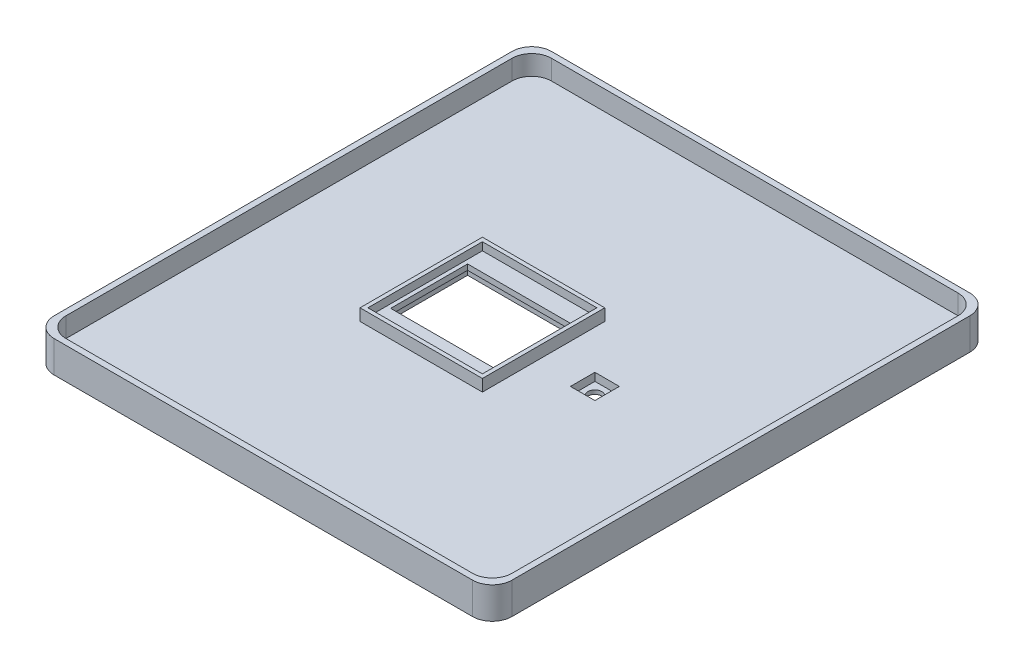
from build123d import *

# Parameters (mm, degrees)
SKETCH1_W           = 116
SKETCH1_H           = 126
BOSS_EXTRUDE1_DEPTH = 3
SKETCH2_W           = 116
SKETCH2_H           = 126
SKETCH2_W_2         = 113
SKETCH2_H_2         = 123
BOSS_EXTRUDE2_DEPTH = 5
FILLET1_R           = 5
SKETCH3_W           = 27
SKETCH3_H           = 19.5
SKETCH3_R           = 1.75
CUT_EXTRUDE1_DEPTH  = 5
SKETCH4_W           = 1.028086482
SKETCH4_H           = 8
SKETCH4_H_2         = 5.475045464
SKETCH4_W_2         = 1.028086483
CUT_EXTRUDE2_DEPTH  = 1
SKETCH5_W           = 30
SKETCH5_H           = 22.5
CUT_EXTRUDE3_DEPTH  = 2.6
SKETCH6_W           = 31
SKETCH6_H           = 31
SKETCH6_W_2         = 29
SKETCH6_H_2         = 29
BOSS_EXTRUDE3_DEPTH = 3
SKETCH7_W           = 29
SKETCH7_H           = 29
SKETCH7_W_2         = 27
SKETCH7_H_2         = 19.5
BOSS_EXTRUDE4_DEPTH = 1
SKETCH8_W           = 6.2
SKETCH8_H           = 6.2
CUT_EXTRUDE4_DEPTH  = 2


with BuildPart() as part:
    # Sketch1 → Boss-Extrude1 (new body)
    with BuildSketch(Plane(origin=(0, 0, 0), x_dir=(1, 0, 0), z_dir=(0, 1, 0))):
        Rectangle(SKETCH1_W, SKETCH1_H)
    extrude(amount=BOSS_EXTRUDE1_DEPTH)

    # Sketch2 → Boss-Extrude2 (add)
    with BuildSketch(Plane(origin=(0, 3, 0), x_dir=(1, 0, 0), z_dir=(0, 1, 0))):
        Rectangle(SKETCH2_W, SKETCH2_H)
        Rectangle(SKETCH2_W_2, SKETCH2_H_2, mode=Mode.SUBTRACT)
    extrude(amount=BOSS_EXTRUDE2_DEPTH)

    # Fillet1
    fillet1_edges = [part.edges().sort_by_distance(p)[0] for p in [
        (-56.5, 5.5, 61.5),
        (56.5, 5.5, 61.5),
        (56.5, 5.5, -61.5),
        (-56.5, 5.5, -61.5),
        (-58, 4, -63),
        (58, 4, -63),
        (58, 4, 63),
        (-58, 4, 63),
    ]]
    fillet(fillet1_edges, radius=FILLET1_R)

    # Sketch3 → Cut-Extrude1 (cut)
    with BuildSketch(Plane.XZ):
        with Locations((-7.5, 0)):
            Rectangle(SKETCH3_W, SKETCH3_H)
        with Locations(Location((21, 0, 0), (0, 0, 270))):
            Circle(SKETCH3_R)
    extrude(amount=-CUT_EXTRUDE1_DEPTH, mode=Mode.SUBTRACT)

    # Sketch4 → Cut-Extrude2 (cut)
    # profile 1 of 19: a face of its own
    with BuildSketch(Plane.XZ):
        Polygon((-46.226207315, 33.425283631), (-47.365831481, 33.425283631), (-44.349464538, 41.425283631), (-43.187209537, 41.425283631), (-40.170842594, 33.425283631), (-41.310466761, 33.425283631), (-42.081531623, 35.59299428), (-45.443827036, 35.59299428), align=None)
        Polygon((-43.790159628, 40.162806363), (-45.097898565, 36.553188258), (-42.43877551, 36.553188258), (-43.746514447, 40.162806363), align=None, mode=Mode.SUBTRACT)
    # profile 2 of 19: a face of its own
    with BuildSketch(Plane.XZ):
        with BuildLine():
            Line((-39.425641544, 38.900329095), (-38.442816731, 38.900329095))
            Line((-38.442816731, 38.900329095), (-38.442816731, 38.140579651))
            Line((-38.442816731, 38.140579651), (-38.397555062, 38.140579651))
            add(Edge.make_bspline(
                [(-38.397555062, 38.140579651), (-38.355324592, 38.206180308), (-38.269471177, 38.33954469), (-38.10105788, 38.515514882), (-37.903306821, 38.674796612), (-37.679016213, 38.814862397), (-37.437235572, 38.932096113), (-37.184721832, 39.016649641), (-36.927121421, 39.069234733), (-36.753291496, 39.075171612), (-36.666296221, 39.078142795)],
                knots=[0, 0, 0, 0, 0.91084183, 1.851717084, 2.833096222, 3.875309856, 4.938074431, 5.968501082, 6.983311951, 8, 8, 8, 8], degree=3))
            add(Edge.make_bspline(
                [(-36.666296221, 39.078142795), (-36.584874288, 39.076073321), (-36.426459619, 39.072046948), (-36.195789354, 39.04683856), (-35.979930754, 39.001384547), (-35.778218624, 38.938685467), (-35.590944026, 38.857003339), (-35.416644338, 38.759217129), (-35.259490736, 38.639589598), (-35.11639207, 38.504717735), (-34.987769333, 38.354274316), (-34.877619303, 38.185946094), (-34.783991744, 38.003292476), (-34.707428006, 37.804948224), (-34.648095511, 37.592178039), (-34.606749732, 37.363797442), (-34.579985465, 37.120675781), (-34.577471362, 36.953074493), (-34.576177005, 36.866786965)],
                knots=[0, 0, 0, 0, 1.127999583, 2.194638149, 3.209152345, 4.179425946, 5.11544511, 6.034797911, 6.940965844, 7.843900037, 8.754728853, 9.675988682, 10.624073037, 11.592996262, 12.616259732, 13.679130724, 14.805128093, 16, 16, 16, 16], degree=3))
            Line((-34.576177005, 36.866786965), (-34.576177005, 33.425283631))
            Line((-34.576177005, 33.425283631), (-35.604263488, 33.425283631))
            Line((-35.604263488, 33.425283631), (-35.604263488, 36.798894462))
            add(Edge.make_bspline(
                [(-35.604263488, 36.798894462), (-35.606729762, 36.853372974), (-35.611505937, 36.958875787), (-35.630985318, 37.111287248), (-35.660120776, 37.252865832), (-35.698183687, 37.384881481), (-35.748943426, 37.50550139), (-35.806240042, 37.617426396), (-35.877782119, 37.716275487), (-35.955554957, 37.808192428), (-36.047941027, 37.885031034), (-36.147384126, 37.954391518), (-36.25756983, 38.01249797), (-36.378275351, 38.058898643), (-36.508429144, 38.09686509), (-36.64887931, 38.121255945), (-36.798955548, 38.138595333), (-36.902248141, 38.13990341), (-36.955647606, 38.140579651)],
                knots=[0, 0, 0, 0, 1.204564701, 2.33275393, 3.3904596, 4.396236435, 5.362408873, 6.278428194, 7.166956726, 8.052849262, 8.930947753, 9.812670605, 10.728689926, 11.674925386, 12.665937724, 13.71907735, 14.820824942, 16, 16, 16, 16], degree=3))
            add(Edge.make_bspline(
                [(-36.955647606, 38.140579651), (-37.005833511, 38.138897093), (-37.105099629, 38.135569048), (-37.250660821, 38.113079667), (-37.390008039, 38.073635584), (-37.522374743, 38.018774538), (-37.648602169, 37.948037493), (-37.768673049, 37.862121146), (-37.881652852, 37.75941), (-37.987867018, 37.643708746), (-38.083266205, 37.517046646), (-38.168784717, 37.384381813), (-38.237792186, 37.243791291), (-38.296696, 37.09821523), (-38.341907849, 36.945531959), (-38.374070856, 36.786516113), (-38.39392901, 36.621584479), (-38.396337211, 36.509598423), (-38.397555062, 36.452965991)],
                knots=[0, 0, 0, 0, 0.975459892, 1.929428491, 2.854499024, 3.784241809, 4.707947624, 5.661283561, 6.647647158, 7.670643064, 8.709652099, 9.726625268, 10.733680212, 11.748926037, 12.776202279, 13.823780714, 14.899464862, 16, 16, 16, 16], degree=3))
            Line((-38.397555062, 36.452965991), (-38.397555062, 33.425283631))
            Line((-38.397555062, 33.425283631), (-39.425641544, 33.425283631))
            Line((-39.425641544, 33.425283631), (-39.425641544, 38.900329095))
        make_face()
    # profile 3 of 19: a face of its own
    with BuildSketch(Plane.XZ):
        with BuildLine():
            add(Edge.make_bspline(
                [(-31.242978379, 39.078142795), (-31.15021125, 39.076436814), (-30.96958618, 39.073115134), (-30.706497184, 39.042812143), (-30.458060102, 38.996941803), (-30.224577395, 38.930921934), (-30.006303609, 38.844839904), (-29.803041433, 38.739380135), (-29.614948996, 38.614735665), (-29.443321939, 38.471535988), (-29.287019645, 38.313846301), (-29.153041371, 38.138257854), (-29.03895201, 37.949728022), (-28.946139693, 37.746774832), (-28.873563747, 37.530041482), (-28.822072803, 37.298759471), (-28.790762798, 37.053549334), (-28.78755892, 36.885202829), (-28.785916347, 36.798894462)],
                knots=[0, 0, 0, 0, 1.173219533, 2.284352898, 3.345908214, 4.366555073, 5.348874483, 6.309307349, 7.258424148, 8.19757393, 9.132756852, 10.061282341, 10.984865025, 11.915190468, 12.87878731, 13.871061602, 14.908529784, 16, 16, 16, 16], degree=3))
            Line((-28.785916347, 36.798894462), (-28.785916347, 33.425283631))
            Line((-28.785916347, 33.425283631), (-29.76874116, 33.425283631))
            Line((-29.76874116, 33.425283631), (-29.76874116, 34.185033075))
            Line((-29.76874116, 34.185033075), (-29.814002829, 34.185033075))
            add(Edge.make_bspline(
                [(-29.814002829, 34.185033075), (-29.867992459, 34.110558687), (-29.973034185, 33.965662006), (-30.152441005, 33.772812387), (-30.345818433, 33.610205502), (-30.552402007, 33.475168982), (-30.774371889, 33.374115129), (-31.007665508, 33.2979375), (-31.255333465, 33.253979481), (-31.424932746, 33.248595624), (-31.511315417, 33.245853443)],
                knots=[0, 0, 0, 0, 1.089008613, 2.118765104, 3.110978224, 4.075960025, 5.032714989, 5.991597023, 6.977052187, 8, 8, 8, 8], degree=3))
            add(Edge.make_bspline(
                [(-31.511315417, 33.245853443), (-31.5852147, 33.247223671), (-31.730789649, 33.249922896), (-31.943822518, 33.276597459), (-32.147654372, 33.318680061), (-32.342742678, 33.376711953), (-32.528485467, 33.452489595), (-32.704443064, 33.545904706), (-32.871919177, 33.654086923), (-33.027498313, 33.779664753), (-33.168498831, 33.917406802), (-33.293101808, 34.064188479), (-33.399119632, 34.219827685), (-33.484470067, 34.385121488), (-33.551841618, 34.557862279), (-33.598179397, 34.739190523), (-33.628521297, 34.928676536), (-33.631998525, 35.058356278), (-33.633764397, 35.124212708)],
                knots=[0, 0, 0, 0, 1.120632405, 2.207545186, 3.251209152, 4.27532258, 5.290852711, 6.289095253, 7.293510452, 8.310979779, 9.316791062, 10.279701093, 11.227397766, 12.167022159, 13.096062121, 14.033871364, 15.001523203, 16, 16, 16, 16], degree=3))
            add(Edge.make_bspline(
                [(-33.633764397, 35.124212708), (-33.632156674, 35.193311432), (-33.629012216, 35.328457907), (-33.596858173, 35.525654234), (-33.547228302, 35.712256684), (-33.477669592, 35.888613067), (-33.386139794, 36.052684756), (-33.275010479, 36.20631246), (-33.143440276, 36.348712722), (-32.992736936, 36.479035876), (-32.826557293, 36.597553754), (-32.644216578, 36.698618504), (-32.449795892, 36.787433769), (-32.239977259, 36.855590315), (-32.017932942, 36.910516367), (-31.783095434, 36.951470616), (-31.53436972, 36.973420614), (-31.364255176, 36.976661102), (-31.276924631, 36.97832465)],
                knots=[0, 0, 0, 0, 0.982513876, 1.921646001, 2.834880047, 3.726188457, 4.611673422, 5.501232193, 6.418288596, 7.363908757, 8.331894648, 9.317186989, 10.326151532, 11.368758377, 12.451067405, 13.579254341, 14.757278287, 16, 16, 16, 16], degree=3))
            add(Edge.make_bspline(
                [(-31.276924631, 36.97832465), (-31.201991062, 36.977609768), (-31.055710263, 36.976214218), (-30.841583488, 36.959034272), (-30.637398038, 36.9341507), (-30.443680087, 36.896788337), (-30.260101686, 36.849896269), (-30.086451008, 36.793519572), (-29.922186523, 36.726238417), (-29.819495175, 36.671008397), (-29.76874116, 36.643711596)],
                knots=[0, 0, 0, 0, 1.151258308, 2.247417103, 3.299139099, 4.31088676, 5.276906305, 6.209116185, 7.114876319, 8, 8, 8, 8], degree=3))
            Line((-29.76874116, 36.643711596), (-29.76874116, 36.878102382))
            add(Edge.make_bspline(
                [(-29.76874116, 36.878102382), (-29.770017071, 36.921807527), (-29.772550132, 37.008575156), (-29.791736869, 37.136263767), (-29.826385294, 37.258580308), (-29.873545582, 37.375622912), (-29.933223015, 37.487648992), (-30.007693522, 37.593407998), (-30.092748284, 37.696066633), (-30.192977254, 37.789678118), (-30.300728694, 37.876288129), (-30.41252493, 37.954589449), (-30.531506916, 38.017748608), (-30.653192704, 38.071716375), (-30.780983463, 38.111275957), (-30.911784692, 38.143715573), (-31.048663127, 38.158572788), (-31.141117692, 38.161649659), (-31.188017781, 38.163210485)],
                knots=[0, 0, 0, 0, 0.987325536, 1.960133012, 2.908327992, 3.853313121, 4.806496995, 5.768965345, 6.771264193, 7.813222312, 8.860854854, 9.894171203, 10.89105799, 11.899768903, 12.896953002, 13.909842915, 14.939711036, 16, 16, 16, 16], degree=3))
            add(Edge.make_bspline(
                [(-31.188017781, 38.163210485), (-31.258214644, 38.161180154), (-31.395160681, 38.157219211), (-31.594924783, 38.121998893), (-31.783455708, 38.065624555), (-31.961786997, 37.986116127), (-32.126947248, 37.881094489), (-32.282474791, 37.755674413), (-32.425060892, 37.606098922), (-32.508266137, 37.493326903), (-32.550717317, 37.435790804)],
                knots=[0, 0, 0, 0, 1.044346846, 2.037401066, 3.00936587, 3.968031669, 4.933986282, 5.914946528, 6.936209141, 8, 8, 8, 8], degree=3))
            Line((-32.550717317, 37.435790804), (-33.455950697, 38.006411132))
            add(Edge.make_bspline(
                [(-33.455950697, 38.006411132), (-33.391663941, 38.09159897), (-33.265119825, 38.259285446), (-33.042750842, 38.479596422), (-32.797173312, 38.664894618), (-32.529038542, 38.816513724), (-32.239155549, 38.935402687), (-31.926785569, 39.018562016), (-31.592234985, 39.070042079), (-31.361714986, 39.075388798), (-31.242978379, 39.078142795)],
                knots=[0, 0, 0, 0, 0.998040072, 1.964574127, 2.918870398, 3.869801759, 4.840171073, 5.843473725, 6.889213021, 8, 8, 8, 8], degree=3))
        make_face()
        with BuildLine():
            add(Edge.make_bspline(
                [(-32.573348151, 35.101581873), (-32.569674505, 35.036850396), (-32.562437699, 34.909334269), (-32.493201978, 34.728176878), (-32.384002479, 34.564482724), (-32.233640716, 34.424838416), (-32.058938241, 34.30722055), (-31.862461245, 34.225310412), (-31.653351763, 34.17008498), (-31.507909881, 34.164997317), (-31.433723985, 34.162402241)],
                knots=[0, 0, 0, 0, 0.945466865, 1.862498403, 2.802240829, 3.807754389, 4.850454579, 5.873008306, 6.915080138, 8, 8, 8, 8], degree=3))
            add(Edge.make_bspline(
                [(-31.433723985, 34.162402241), (-31.380295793, 34.164021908), (-31.274577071, 34.167226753), (-31.118173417, 34.190860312), (-30.966464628, 34.227519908), (-30.818968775, 34.279808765), (-30.676618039, 34.348624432), (-30.537541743, 34.430499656), (-30.403752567, 34.529062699), (-30.276558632, 34.640862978), (-30.15800262, 34.761868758), (-30.053380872, 34.890187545), (-29.965742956, 35.024693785), (-29.894638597, 35.164811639), (-29.836578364, 35.308740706), (-29.798947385, 35.458975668), (-29.773019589, 35.61365048), (-29.770181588, 35.718969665), (-29.76874116, 35.772424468)],
                knots=[0, 0, 0, 0, 1.001766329, 1.982201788, 2.96018622, 3.925504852, 4.910927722, 5.921373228, 6.948211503, 8.022490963, 9.094486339, 10.121970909, 11.122666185, 12.098926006, 13.065407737, 14.026272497, 14.998233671, 16, 16, 16, 16], degree=3))
            add(Edge.make_bspline(
                [(-29.76874116, 35.772424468), (-29.810188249, 35.802927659), (-29.894027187, 35.864629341), (-30.03271332, 35.942452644), (-30.183801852, 36.006556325), (-30.346078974, 36.059785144), (-30.519972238, 36.102346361), (-30.706118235, 36.130258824), (-30.903692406, 36.148530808), (-31.039257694, 36.15102139), (-31.108809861, 36.15229919)],
                knots=[0, 0, 0, 0, 0.869949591, 1.759729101, 2.682511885, 3.642365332, 4.646055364, 5.707047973, 6.823594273, 8, 8, 8, 8], degree=3))
            add(Edge.make_bspline(
                [(-31.108809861, 36.15229919), (-31.209340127, 36.148820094), (-31.402957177, 36.142119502), (-31.680333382, 36.083872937), (-31.933176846, 35.991011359), (-32.12024868, 35.878692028), (-32.252977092, 35.775995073), (-32.33762389, 35.692124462), (-32.410915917, 35.605805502), (-32.470019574, 35.513121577), (-32.517352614, 35.416923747), (-32.549410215, 35.315483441), (-32.569951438, 35.210181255), (-32.572199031, 35.138321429), (-32.573348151, 35.101581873)],
                knots=[0, 0, 0, 0, 1.808996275, 3.484050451, 5.081205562, 6.639190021, 7.392547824, 8.099459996, 8.781689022, 9.427823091, 10.074612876, 10.706894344, 11.338877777, 12, 12, 12, 12], degree=3))
        make_face(mode=Mode.SUBTRACT)
    # profile 4 of 19: a face of its own
    with BuildSketch(Plane.XZ):
        with Locations((-27.117700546, 37.425283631)):
            Rectangle(SKETCH4_W, SKETCH4_H)
    # profile 5 of 19: a face of its own
    with BuildSketch(Plane.XZ):
        Polygon((-20.461002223, 38.900329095), (-23.891190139, 31.011866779), (-24.953222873, 31.011866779), (-23.679430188, 33.771212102), (-25.936047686, 38.900329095), (-24.819054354, 38.900329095), (-23.188017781, 34.967413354), (-23.165386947, 34.967413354), (-21.579612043, 38.900329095), align=None)
    # profile 6 of 19: a face of its own
    with BuildSketch(Plane.XZ):
        with BuildLine():
            add(Edge.make_bspline(
                [(-15.579207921, 34.94478252), (-15.5810058, 34.886459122), (-15.584558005, 34.771225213), (-15.614862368, 34.601960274), (-15.662893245, 34.438644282), (-15.733557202, 34.283594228), (-15.821278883, 34.134167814), (-15.931120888, 33.994184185), (-16.057401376, 33.858427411), (-16.204298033, 33.734112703), (-16.364975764, 33.620140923), (-16.53689326, 33.518662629), (-16.720149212, 33.435770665), (-16.912040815, 33.364782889), (-17.115298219, 33.312287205), (-17.32809742, 33.273435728), (-17.551369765, 33.250662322), (-17.703221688, 33.247480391), (-17.780864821, 33.245853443)],
                knots=[0, 0, 0, 0, 0.904518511, 1.787125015, 2.660172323, 3.539802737, 4.424664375, 5.342916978, 6.295372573, 7.297625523, 8.323189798, 9.350082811, 10.390270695, 11.440494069, 12.521591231, 13.643508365, 14.795106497, 16, 16, 16, 16], degree=3))
            add(Edge.make_bspline(
                [(-17.780864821, 33.245853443), (-17.848830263, 33.246845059), (-17.982942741, 33.248801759), (-18.180318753, 33.271833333), (-18.372289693, 33.30196606), (-18.556325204, 33.352344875), (-18.735762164, 33.411428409), (-18.908180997, 33.485769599), (-19.074134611, 33.574168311), (-19.233523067, 33.673340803), (-19.383689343, 33.785452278), (-19.5243532, 33.905726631), (-19.652301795, 34.036575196), (-19.771017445, 34.173137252), (-19.876485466, 34.320413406), (-19.971752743, 34.475315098), (-20.056607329, 34.638859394), (-20.103023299, 34.753103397), (-20.12638917, 34.810614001)],
                knots=[0, 0, 0, 0, 1.085195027, 2.141355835, 3.171624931, 4.186385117, 5.185432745, 6.188034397, 7.181540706, 8.187094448, 9.183951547, 10.172747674, 11.140600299, 12.105116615, 13.060795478, 14.030789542, 15.008696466, 16, 16, 16, 16], degree=3))
            Line((-20.12638917, 34.810614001), (-19.209840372, 35.20180414))
            add(Edge.make_bspline(
                [(-19.209840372, 35.20180414), (-19.175055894, 35.122916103), (-19.107282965, 34.969213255), (-18.967203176, 34.764445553), (-18.811410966, 34.581629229), (-18.629018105, 34.432056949), (-18.432129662, 34.311793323), (-18.223498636, 34.22491214), (-18.004826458, 34.173128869), (-17.856034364, 34.166002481), (-17.780864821, 34.162402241)],
                knots=[0, 0, 0, 0, 1.099967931, 2.143141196, 3.158607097, 4.161447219, 5.144381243, 6.098729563, 7.03948102, 8, 8, 8, 8], degree=3))
            add(Edge.make_bspline(
                [(-17.780864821, 34.162402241), (-17.702008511, 34.164563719), (-17.549638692, 34.168740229), (-17.331917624, 34.20966793), (-17.134565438, 34.276163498), (-16.961149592, 34.366825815), (-16.817521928, 34.476399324), (-16.709696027, 34.598736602), (-16.642441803, 34.735008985), (-16.634073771, 34.830945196), (-16.629925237, 34.878506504)],
                knots=[0, 0, 0, 0, 1.271321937, 2.456507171, 3.559082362, 4.620861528, 5.600003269, 6.457252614, 7.235167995, 8, 8, 8, 8], degree=3))
            add(Edge.make_bspline(
                [(-16.629925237, 34.878506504), (-16.632456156, 34.920813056), (-16.637457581, 35.00441631), (-16.676387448, 35.12541375), (-16.740776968, 35.236740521), (-16.83081049, 35.338610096), (-16.945621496, 35.431166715), (-17.08658458, 35.512480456), (-17.250654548, 35.587189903), (-17.370376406, 35.627016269), (-17.433319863, 35.647954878)],
                knots=[0, 0, 0, 0, 0.847864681, 1.675491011, 2.523148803, 3.412212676, 4.388351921, 5.469523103, 6.669608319, 8, 8, 8, 8], degree=3))
            Line((-17.433319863, 35.647954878), (-18.372499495, 35.883962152))
            add(Edge.make_bspline(
                [(-18.372499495, 35.883962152), (-18.43731588, 35.901192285), (-18.563401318, 35.934709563), (-18.744918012, 35.992791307), (-18.913514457, 36.057121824), (-19.069057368, 36.128836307), (-19.212964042, 36.204299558), (-19.344927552, 36.284888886), (-19.463573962, 36.372911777), (-19.570806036, 36.466298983), (-19.664798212, 36.566728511), (-19.745791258, 36.672736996), (-19.816862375, 36.782467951), (-19.871466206, 36.900524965), (-19.914905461, 37.023449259), (-19.948405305, 37.151912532), (-19.965399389, 37.286614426), (-19.968180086, 37.378096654), (-19.969589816, 37.424475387)],
                knots=[0, 0, 0, 0, 1.334116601, 2.595218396, 3.789682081, 4.921713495, 6.000627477, 7.021026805, 7.994395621, 8.936265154, 9.846365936, 10.725445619, 11.587897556, 12.441443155, 13.306024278, 14.179596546, 15.07711029, 16, 16, 16, 16], degree=3))
            add(Edge.make_bspline(
                [(-19.969589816, 37.424475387), (-19.967867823, 37.485498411), (-19.964494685, 37.605033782), (-19.933793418, 37.779451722), (-19.887821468, 37.945372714), (-19.820826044, 38.101826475), (-19.73448391, 38.248520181), (-19.628380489, 38.384687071), (-19.504042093, 38.511851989), (-19.362013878, 38.629281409), (-19.204647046, 38.734791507), (-19.035831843, 38.827221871), (-18.856456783, 38.905850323), (-18.665473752, 38.967660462), (-18.464724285, 39.018375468), (-18.253359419, 39.053530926), (-18.031333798, 39.075008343), (-17.879521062, 39.077082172), (-17.801879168, 39.078142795)],
                knots=[0, 0, 0, 0, 0.958787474, 1.878127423, 2.776615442, 3.661091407, 4.54605424, 5.44597933, 6.368709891, 7.337478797, 8.338573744, 9.343426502, 10.36031683, 11.413312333, 12.496288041, 13.613427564, 14.779430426, 16, 16, 16, 16], degree=3))
            add(Edge.make_bspline(
                [(-17.801879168, 39.078142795), (-17.683578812, 39.07434314), (-17.450532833, 39.066858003), (-17.110399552, 39.000488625), (-16.788076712, 38.891052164), (-16.536113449, 38.76495999), (-16.348964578, 38.643801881), (-16.217138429, 38.547417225), (-16.097684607, 38.441873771), (-15.988337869, 38.330066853), (-15.890940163, 38.209923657), (-15.805426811, 38.081973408), (-15.730430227, 37.947218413), (-15.688948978, 37.853191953), (-15.668114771, 37.805966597)],
                knots=[0, 0, 0, 0, 1.615560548, 3.182576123, 4.714895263, 6.256159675, 7.018078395, 7.760385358, 8.485695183, 9.193944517, 9.895500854, 10.596051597, 11.294858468, 12, 12, 12, 12], degree=3))
            Line((-15.668114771, 37.805966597), (-16.584663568, 37.424475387))
            add(Edge.make_bspline(
                [(-16.584663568, 37.424475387), (-16.612973, 37.480568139), (-16.669171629, 37.591920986), (-16.787000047, 37.739444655), (-16.929274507, 37.866051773), (-17.093247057, 37.97237964), (-17.273372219, 38.057234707), (-17.466009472, 38.119743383), (-17.670174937, 38.155277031), (-17.809827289, 38.16053005), (-17.881087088, 38.163210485)],
                knots=[0, 0, 0, 0, 0.954239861, 1.894314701, 2.85252816, 3.841956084, 4.858075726, 5.874691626, 6.915528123, 8, 8, 8, 8], degree=3))
            add(Edge.make_bspline(
                [(-17.881087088, 38.163210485), (-17.946458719, 38.160665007), (-18.075052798, 38.155657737), (-18.262568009, 38.117885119), (-18.439649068, 38.054122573), (-18.600346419, 37.9668633), (-18.740598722, 37.865197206), (-18.84372233, 37.745685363), (-18.910206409, 37.612221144), (-18.91705379, 37.517338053), (-18.920488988, 37.469737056)],
                knots=[0, 0, 0, 0, 1.144154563, 2.25069348, 3.334102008, 4.427489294, 5.444613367, 6.348279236, 7.171363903, 8, 8, 8, 8], degree=3))
            add(Edge.make_bspline(
                [(-18.920488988, 37.469737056), (-18.917478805, 37.431683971), (-18.911498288, 37.356081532), (-18.869283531, 37.247148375), (-18.795792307, 37.150109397), (-18.697581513, 37.061062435), (-18.571477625, 36.981433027), (-18.418309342, 36.911550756), (-18.238024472, 36.848555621), (-18.107177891, 36.816088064), (-18.037886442, 36.798894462)],
                knots=[0, 0, 0, 0, 0.764096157, 1.518077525, 2.308489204, 3.189705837, 4.168714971, 5.292382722, 6.566147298, 8, 8, 8, 8], degree=3))
            Line((-18.037886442, 36.798894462), (-17.210244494, 36.58713451))
            add(Edge.make_bspline(
                [(-17.210244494, 36.58713451), (-17.14432246, 36.570011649), (-17.015884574, 36.536650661), (-16.83057764, 36.4767165), (-16.658666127, 36.409095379), (-16.498828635, 36.335908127), (-16.350978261, 36.257529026), (-16.217268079, 36.169693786), (-16.094944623, 36.077695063), (-15.985519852, 35.978721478), (-15.890016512, 35.87168043), (-15.807447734, 35.75833501), (-15.736878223, 35.638769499), (-15.678757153, 35.512679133), (-15.632982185, 35.380126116), (-15.603019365, 35.240562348), (-15.582632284, 35.095178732), (-15.580362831, 34.995505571), (-15.579207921, 34.94478252)],
                knots=[0, 0, 0, 0, 1.295749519, 2.524547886, 3.703045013, 4.808647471, 5.86827711, 6.88347711, 7.849277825, 8.778242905, 9.68586014, 10.573807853, 11.442427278, 12.323184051, 13.211545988, 14.104510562, 15.035397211, 16, 16, 16, 16], degree=3))
        make_face()
    # profile 7 of 19: a face of its own
    with BuildSketch(Plane.XZ):
        with BuildLine():
            add(Edge.make_bspline(
                [(-12.24115983, 33.245853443), (-12.339899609, 33.248215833), (-12.533321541, 33.252843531), (-12.816509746, 33.292774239), (-13.086296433, 33.357144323), (-13.343306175, 33.447920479), (-13.586553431, 33.565423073), (-13.818194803, 33.705911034), (-14.033770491, 33.876124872), (-14.234506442, 34.068955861), (-14.416807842, 34.28147373), (-14.57566866, 34.510248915), (-14.710537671, 34.752260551), (-14.821277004, 35.007764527), (-14.906631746, 35.277051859), (-14.968576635, 35.559924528), (-15.003801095, 35.856667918), (-15.009115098, 36.058991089), (-15.01182057, 36.161998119)],
                knots=[0, 0, 0, 0, 1.051520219, 2.059829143, 3.040031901, 4.002319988, 4.957458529, 5.913441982, 6.882639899, 7.877342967, 8.874825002, 9.860542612, 10.839635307, 11.821802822, 12.822121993, 13.844516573, 14.902597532, 16, 16, 16, 16], degree=3))
            add(Edge.make_bspline(
                [(-15.01182057, 36.161998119), (-15.00988572, 36.264487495), (-15.006095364, 36.465263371), (-14.969245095, 36.760029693), (-14.910400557, 37.04161549), (-14.825555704, 37.309836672), (-14.718376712, 37.564626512), (-14.589585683, 37.807523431), (-14.431864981, 38.034114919), (-14.255858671, 38.248484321), (-14.06044729, 38.442570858), (-13.849659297, 38.612499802), (-13.626277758, 38.75806097), (-13.386916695, 38.873340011), (-13.136949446, 38.967435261), (-12.872565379, 39.031234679), (-12.595316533, 39.071099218), (-12.405642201, 39.075766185), (-12.309052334, 39.078142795)],
                knots=[0, 0, 0, 0, 1.10480568, 2.164305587, 3.197995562, 4.20326819, 5.192901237, 6.175617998, 7.162021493, 8.164940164, 9.163404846, 10.126267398, 11.080464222, 12.031612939, 12.985809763, 13.955434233, 14.958824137, 16, 16, 16, 16], degree=3))
            add(Edge.make_bspline(
                [(-12.309052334, 39.078142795), (-12.209806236, 39.075487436), (-12.016049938, 39.07030343), (-11.733281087, 39.034904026), (-11.466009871, 38.973699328), (-11.2151352, 38.885602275), (-10.978231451, 38.776147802), (-10.75894292, 38.638486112), (-10.554111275, 38.478098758), (-10.366540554, 38.292773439), (-10.196369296, 38.086891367), (-10.05079821, 37.857984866), (-9.925264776, 37.610965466), (-9.823732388, 37.343762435), (-9.746649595, 37.056490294), (-9.690255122, 36.750064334), (-9.656085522, 36.423565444), (-9.652014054, 36.199260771), (-9.649929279, 36.084406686)],
                knots=[0, 0, 0, 0, 1.050950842, 2.051751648, 3.012377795, 3.948993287, 4.862874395, 5.770175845, 6.684555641, 7.612632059, 8.557347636, 9.507064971, 10.479365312, 11.487201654, 12.528190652, 13.625017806, 14.783902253, 16, 16, 16, 16], degree=3))
            Line((-9.649929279, 36.084406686), (-9.661244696, 35.972869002))
            Line((-9.661244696, 35.972869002), (-13.962719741, 35.972869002))
            add(Edge.make_bspline(
                [(-13.962719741, 35.972869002), (-13.959645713, 35.907553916), (-13.953595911, 35.779011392), (-13.923569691, 35.591979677), (-13.880746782, 35.414053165), (-13.819689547, 35.246755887), (-13.746458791, 35.08759071), (-13.654483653, 34.939968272), (-13.549173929, 34.801170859), (-13.428200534, 34.675118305), (-13.297584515, 34.560064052), (-13.158898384, 34.460022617), (-13.013709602, 34.375310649), (-12.863047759, 34.304987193), (-12.70505719, 34.251966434), (-12.541778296, 34.212849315), (-12.371668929, 34.18986168), (-12.25631632, 34.186663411), (-12.197514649, 34.185033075)],
                knots=[0, 0, 0, 0, 1.120851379, 2.205877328, 3.243819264, 4.255416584, 5.256059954, 6.243683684, 7.232733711, 8.239590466, 9.235183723, 10.215121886, 11.167874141, 12.114915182, 13.061956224, 14.021499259, 14.991447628, 16, 16, 16, 16], degree=3))
            add(Edge.make_bspline(
                [(-12.197514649, 34.185033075), (-12.117567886, 34.188308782), (-11.960673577, 34.194737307), (-11.731505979, 34.24045337), (-11.516912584, 34.319087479), (-11.314632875, 34.426754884), (-11.12836521, 34.568094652), (-10.953633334, 34.738097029), (-10.793158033, 34.939292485), (-10.702185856, 35.090215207), (-10.655384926, 35.167857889)],
                knots=[0, 0, 0, 0, 0.996588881, 1.955790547, 2.899431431, 3.837242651, 4.80200441, 5.804486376, 6.870510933, 8, 8, 8, 8], degree=3))
            Line((-10.655384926, 35.167857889), (-9.738836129, 34.721707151))
            add(Edge.make_bspline(
                [(-9.738836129, 34.721707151), (-9.770556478, 34.665313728), (-9.833565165, 34.553294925), (-9.938004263, 34.392946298), (-10.054221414, 34.244127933), (-10.176633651, 34.102662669), (-10.309595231, 33.971332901), (-10.452656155, 33.850547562), (-10.602201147, 33.736704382), (-10.761688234, 33.635100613), (-10.927030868, 33.543020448), (-11.098863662, 33.463605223), (-11.276230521, 33.397121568), (-11.458851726, 33.342454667), (-11.646574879, 33.298335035), (-11.839972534, 33.267678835), (-12.038763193, 33.249927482), (-12.173232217, 33.247220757), (-12.24115983, 33.245853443)],
                knots=[0, 0, 0, 0, 1.015288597, 2.016749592, 2.999434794, 3.976281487, 4.950929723, 5.928654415, 6.912939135, 7.898095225, 8.893540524, 9.881016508, 10.865773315, 11.863622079, 12.870743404, 13.889757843, 14.934001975, 16, 16, 16, 16], degree=3))
        make_face()
        with BuildLine():
            Line((-13.883511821, 36.821525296), (-10.744291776, 36.821525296))
            add(Edge.make_bspline(
                [(-10.744291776, 36.821525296), (-10.749552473, 36.867958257), (-10.759953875, 36.95976509), (-10.786976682, 37.094319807), (-10.827352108, 37.222899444), (-10.881665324, 37.343897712), (-10.944297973, 37.460200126), (-11.021035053, 37.568566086), (-11.10934105, 37.670687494), (-11.206843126, 37.768173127), (-11.317434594, 37.854282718), (-11.434389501, 37.933321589), (-11.563093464, 37.995623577), (-11.698653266, 38.05031828), (-11.84504579, 38.088892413), (-11.999027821, 38.1215083), (-12.162760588, 38.135953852), (-12.274553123, 38.139015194), (-12.331683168, 38.140579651)],
                knots=[0, 0, 0, 0, 0.978890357, 1.93545319, 2.87099602, 3.796125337, 4.710722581, 5.634748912, 6.571585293, 7.537629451, 8.518016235, 9.504430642, 10.489034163, 11.507994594, 12.562610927, 13.656446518, 14.80235905, 16, 16, 16, 16], degree=3))
            add(Edge.make_bspline(
                [(-12.331683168, 38.140579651), (-12.379169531, 38.139979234), (-12.472879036, 38.138794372), (-12.610550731, 38.119446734), (-12.74374445, 38.092661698), (-12.872392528, 38.054022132), (-12.994730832, 38.001824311), (-13.11257788, 37.939622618), (-13.225691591, 37.86740452), (-13.367473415, 37.754860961), (-13.527763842, 37.592149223), (-13.686447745, 37.364782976), (-13.80788346, 37.10516244), (-13.85782533, 36.917860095), (-13.883511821, 36.821525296)],
                knots=[0, 0, 0, 0, 0.772256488, 1.523969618, 2.258447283, 2.982588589, 3.705826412, 4.41985882, 5.149713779, 5.886648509, 7.362708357, 8.849309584, 10.379512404, 12, 12, 12, 12], degree=3))
        make_face(mode=Mode.SUBTRACT)
    # profile 8 of 19: a face of its own
    with BuildSketch(Plane.XZ):
        Polygon((-1.367043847, 41.425283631), (-1.367043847, 40.442458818), (-5.008991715, 40.442458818), (-5.008991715, 37.906188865), (-1.724287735, 37.906188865), (-1.724287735, 36.944378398), (-5.008991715, 36.944378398), (-5.008991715, 34.408108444), (-1.367043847, 34.408108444), (-1.367043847, 33.425283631), (-6.037078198, 33.425283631), (-6.037078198, 41.425283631), align=None)
    # profile 9 of 19: a face of its own
    with BuildSketch(Plane.XZ):
        with BuildLine():
            add(Edge.make_bspline(
                [(1.966154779, 39.078142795), (2.058921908, 39.076436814), (2.239546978, 39.073115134), (2.502635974, 39.042812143), (2.751073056, 38.996941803), (2.984555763, 38.930921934), (3.202829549, 38.844839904), (3.406091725, 38.739380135), (3.594184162, 38.614735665), (3.76581122, 38.471535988), (3.922113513, 38.313846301), (4.056091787, 38.138257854), (4.170181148, 37.949728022), (4.262993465, 37.746774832), (4.335569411, 37.530041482), (4.387060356, 37.298759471), (4.41837036, 37.053549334), (4.421574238, 36.885202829), (4.423216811, 36.798894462)],
                knots=[0, 0, 0, 0, 1.173219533, 2.284352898, 3.345908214, 4.366555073, 5.348874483, 6.309307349, 7.258424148, 8.19757393, 9.132756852, 10.061282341, 10.984865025, 11.915190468, 12.87878731, 13.871061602, 14.908529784, 16, 16, 16, 16], degree=3))
            Line((4.423216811, 36.798894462), (4.423216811, 33.425283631))
            Line((4.423216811, 33.425283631), (3.440391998, 33.425283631))
            Line((3.440391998, 33.425283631), (3.440391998, 34.185033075))
            Line((3.440391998, 34.185033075), (3.395130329, 34.185033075))
            add(Edge.make_bspline(
                [(3.395130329, 34.185033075), (3.341140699, 34.110558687), (3.236098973, 33.965662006), (3.056692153, 33.772812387), (2.863314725, 33.610205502), (2.656731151, 33.475168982), (2.434761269, 33.374115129), (2.20146765, 33.2979375), (1.953799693, 33.253979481), (1.784200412, 33.248595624), (1.697817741, 33.245853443)],
                knots=[0, 0, 0, 0, 1.089008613, 2.118765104, 3.110978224, 4.075960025, 5.032714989, 5.991597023, 6.977052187, 8, 8, 8, 8], degree=3))
            add(Edge.make_bspline(
                [(1.697817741, 33.245853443), (1.623918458, 33.247223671), (1.478343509, 33.249922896), (1.26531064, 33.276597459), (1.061478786, 33.318680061), (0.86639048, 33.376711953), (0.680647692, 33.452489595), (0.504690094, 33.545904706), (0.337213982, 33.654086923), (0.181634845, 33.779664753), (0.040634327, 33.917406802), (-0.083968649, 34.064188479), (-0.189986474, 34.219827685), (-0.275336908, 34.385121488), (-0.34270846, 34.557862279), (-0.389046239, 34.739190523), (-0.419388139, 34.928676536), (-0.422865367, 35.058356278), (-0.424631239, 35.124212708)],
                knots=[0, 0, 0, 0, 1.120632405, 2.207545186, 3.251209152, 4.27532258, 5.290852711, 6.289095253, 7.293510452, 8.310979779, 9.316791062, 10.279701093, 11.227397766, 12.167022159, 13.096062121, 14.033871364, 15.001523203, 16, 16, 16, 16], degree=3))
            add(Edge.make_bspline(
                [(-0.424631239, 35.124212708), (-0.423023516, 35.193311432), (-0.419879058, 35.328457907), (-0.387725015, 35.525654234), (-0.338095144, 35.712256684), (-0.268536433, 35.888613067), (-0.177006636, 36.052684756), (-0.06587732, 36.20631246), (0.065692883, 36.348712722), (0.216396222, 36.479035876), (0.382575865, 36.597553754), (0.56491658, 36.698618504), (0.759337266, 36.787433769), (0.969155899, 36.855590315), (1.191200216, 36.910516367), (1.426037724, 36.951470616), (1.674763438, 36.973420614), (1.844877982, 36.976661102), (1.932208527, 36.97832465)],
                knots=[0, 0, 0, 0, 0.982513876, 1.921646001, 2.834880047, 3.726188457, 4.611673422, 5.501232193, 6.418288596, 7.363908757, 8.331894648, 9.317186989, 10.326151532, 11.368758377, 12.451067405, 13.579254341, 14.757278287, 16, 16, 16, 16], degree=3))
            add(Edge.make_bspline(
                [(1.932208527, 36.97832465), (2.007142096, 36.977609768), (2.153422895, 36.976214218), (2.367549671, 36.959034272), (2.57173512, 36.9341507), (2.765453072, 36.896788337), (2.949031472, 36.849896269), (3.12268215, 36.793519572), (3.286946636, 36.726238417), (3.389637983, 36.671008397), (3.440391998, 36.643711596)],
                knots=[0, 0, 0, 0, 1.151258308, 2.247417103, 3.299139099, 4.31088676, 5.276906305, 6.209116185, 7.114876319, 8, 8, 8, 8], degree=3))
            Line((3.440391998, 36.643711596), (3.440391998, 36.878102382))
            add(Edge.make_bspline(
                [(3.440391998, 36.878102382), (3.439116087, 36.921807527), (3.436583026, 37.008575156), (3.41739629, 37.136263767), (3.382747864, 37.258580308), (3.335587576, 37.375622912), (3.275910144, 37.487648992), (3.201439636, 37.593407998), (3.116384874, 37.696066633), (3.016155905, 37.789678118), (2.908404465, 37.876288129), (2.796608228, 37.954589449), (2.677626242, 38.017748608), (2.555940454, 38.071716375), (2.428149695, 38.111275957), (2.297348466, 38.143715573), (2.160470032, 38.158572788), (2.068015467, 38.161649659), (2.021115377, 38.163210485)],
                knots=[0, 0, 0, 0, 0.987325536, 1.960133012, 2.908327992, 3.853313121, 4.806496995, 5.768965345, 6.771264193, 7.813222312, 8.860854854, 9.894171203, 10.89105799, 11.899768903, 12.896953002, 13.909842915, 14.939711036, 16, 16, 16, 16], degree=3))
            add(Edge.make_bspline(
                [(2.021115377, 38.163210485), (1.950918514, 38.161180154), (1.813972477, 38.157219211), (1.614208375, 38.121998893), (1.42567745, 38.065624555), (1.247346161, 37.986116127), (1.082185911, 37.881094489), (0.926658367, 37.755674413), (0.784072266, 37.606098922), (0.700867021, 37.493326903), (0.658415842, 37.435790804)],
                knots=[0, 0, 0, 0, 1.044346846, 2.037401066, 3.00936587, 3.968031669, 4.933986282, 5.914946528, 6.936209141, 8, 8, 8, 8], degree=3))
            Line((0.658415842, 37.435790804), (-0.246817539, 38.006411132))
            add(Edge.make_bspline(
                [(-0.246817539, 38.006411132), (-0.182530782, 38.09159897), (-0.055986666, 38.259285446), (0.166382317, 38.479596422), (0.411959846, 38.664894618), (0.680094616, 38.816513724), (0.969977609, 38.935402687), (1.282347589, 39.018562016), (1.616898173, 39.070042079), (1.847418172, 39.075388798), (1.966154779, 39.078142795)],
                knots=[0, 0, 0, 0, 0.998040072, 1.964574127, 2.918870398, 3.869801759, 4.840171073, 5.843473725, 6.889213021, 8, 8, 8, 8], degree=3))
        make_face()
        with BuildLine():
            add(Edge.make_bspline(
                [(0.635785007, 35.101581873), (0.639458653, 35.036850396), (0.646695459, 34.909334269), (0.71593118, 34.728176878), (0.82513068, 34.564482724), (0.975492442, 34.424838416), (1.150194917, 34.30722055), (1.346671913, 34.225310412), (1.555781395, 34.17008498), (1.701223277, 34.164997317), (1.775409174, 34.162402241)],
                knots=[0, 0, 0, 0, 0.945466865, 1.862498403, 2.802240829, 3.807754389, 4.850454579, 5.873008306, 6.915080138, 8, 8, 8, 8], degree=3))
            add(Edge.make_bspline(
                [(1.775409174, 34.162402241), (1.828837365, 34.164021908), (1.934556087, 34.167226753), (2.090959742, 34.190860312), (2.242668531, 34.227519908), (2.390164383, 34.279808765), (2.532515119, 34.348624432), (2.671591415, 34.430499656), (2.805380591, 34.529062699), (2.932574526, 34.640862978), (3.051130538, 34.761868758), (3.155752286, 34.890187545), (3.243390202, 35.024693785), (3.314494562, 35.164811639), (3.372554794, 35.308740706), (3.410185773, 35.458975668), (3.43611357, 35.61365048), (3.43895157, 35.718969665), (3.440391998, 35.772424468)],
                knots=[0, 0, 0, 0, 1.001766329, 1.982201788, 2.96018622, 3.925504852, 4.910927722, 5.921373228, 6.948211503, 8.022490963, 9.094486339, 10.121970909, 11.122666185, 12.098926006, 13.065407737, 14.026272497, 14.998233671, 16, 16, 16, 16], degree=3))
            add(Edge.make_bspline(
                [(3.440391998, 35.772424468), (3.398944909, 35.802927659), (3.315105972, 35.864629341), (3.176419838, 35.942452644), (3.025331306, 36.006556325), (2.863054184, 36.059785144), (2.68916092, 36.102346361), (2.503014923, 36.130258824), (2.305440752, 36.148530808), (2.169875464, 36.15102139), (2.100323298, 36.15229919)],
                knots=[0, 0, 0, 0, 0.869949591, 1.759729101, 2.682511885, 3.642365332, 4.646055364, 5.707047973, 6.823594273, 8, 8, 8, 8], degree=3))
            add(Edge.make_bspline(
                [(2.100323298, 36.15229919), (1.999793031, 36.148820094), (1.806175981, 36.142119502), (1.528799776, 36.083872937), (1.275956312, 35.991011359), (1.088884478, 35.878692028), (0.956156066, 35.775995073), (0.871509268, 35.692124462), (0.798217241, 35.605805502), (0.739113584, 35.513121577), (0.691780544, 35.416923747), (0.659722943, 35.315483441), (0.63918172, 35.210181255), (0.636934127, 35.138321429), (0.635785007, 35.101581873)],
                knots=[0, 0, 0, 0, 1.808996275, 3.484050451, 5.081205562, 6.639190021, 7.392547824, 8.099459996, 8.781689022, 9.427823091, 10.074612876, 10.706894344, 11.338877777, 12, 12, 12, 12], degree=3))
        make_face(mode=Mode.SUBTRACT)
    # profile 10 of 19: a face of its own
    with BuildSketch(Plane.XZ):
        with BuildLine():
            Line((10.381592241, 33.425283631), (9.398767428, 33.425283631))
            Line((9.398767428, 33.425283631), (9.398767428, 34.185033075))
            Line((9.398767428, 34.185033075), (9.353505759, 34.185033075))
            add(Edge.make_bspline(
                [(9.353505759, 34.185033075), (9.311300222, 34.119400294), (9.225497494, 33.985970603), (9.056451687, 33.810263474), (8.859651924, 33.648448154), (8.6334537, 33.509873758), (8.39241743, 33.39154333), (8.139662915, 33.309707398), (7.883313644, 33.254154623), (7.709287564, 33.248621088), (7.622246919, 33.245853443)],
                knots=[0, 0, 0, 0, 0.910548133, 1.851120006, 2.836160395, 3.883377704, 4.945799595, 5.967924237, 6.983639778, 8, 8, 8, 8], degree=3))
            add(Edge.make_bspline(
                [(7.622246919, 33.245853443), (7.540823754, 33.247920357), (7.382406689, 33.251941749), (7.15175337, 33.277185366), (6.935835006, 33.322515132), (6.733859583, 33.385797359), (6.545841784, 33.46601337), (6.372204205, 33.565845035), (6.21397499, 33.683829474), (6.070201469, 33.81941429), (5.94267135, 33.971255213), (5.832074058, 34.138886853), (5.739514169, 34.32189121), (5.663671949, 34.520229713), (5.604001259, 34.733420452), (5.562713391, 34.96181939), (5.535932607, 35.204935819), (5.53342085, 35.372537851), (5.532127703, 35.458825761)],
                knots=[0, 0, 0, 0, 1.127367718, 2.193408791, 3.207354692, 4.177084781, 5.119425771, 6.031790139, 6.943422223, 7.845850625, 8.76186763, 9.682611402, 10.620126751, 11.595464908, 12.618155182, 13.680430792, 14.805797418, 16, 16, 16, 16], degree=3))
            Line((5.532127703, 35.458825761), (5.532127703, 38.900329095))
            Line((5.532127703, 38.900329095), (6.560214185, 38.900329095))
            Line((6.560214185, 38.900329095), (6.560214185, 35.525101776))
            add(Edge.make_bspline(
                [(6.560214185, 35.525101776), (6.562687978, 35.471160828), (6.567501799, 35.366195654), (6.587131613, 35.213829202), (6.615848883, 35.071618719), (6.653951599, 34.939598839), (6.704813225, 34.819166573), (6.7646804, 34.708538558), (6.834071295, 34.607777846), (6.913825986, 34.518123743), (7.004025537, 34.439413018), (7.104863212, 34.371837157), (7.215051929, 34.313005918), (7.33586311, 34.266723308), (7.465495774, 34.22898123), (7.605859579, 34.204035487), (7.756000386, 34.18713645), (7.859819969, 34.185747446), (7.913214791, 34.185033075)],
                knots=[0, 0, 0, 0, 1.19296348, 2.321420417, 3.391041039, 4.397056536, 5.352463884, 6.274332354, 7.172830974, 8.050006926, 8.919306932, 9.811072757, 10.727309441, 11.673769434, 12.665016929, 13.706696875, 14.820545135, 16, 16, 16, 16], degree=3))
            add(Edge.make_bspline(
                [(7.913214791, 34.185033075), (7.963405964, 34.186679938), (8.062150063, 34.189919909), (8.207115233, 34.212744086), (8.345961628, 34.251959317), (8.478323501, 34.30684393), (8.604557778, 34.377569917), (8.72398504, 34.463063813), (8.836576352, 34.565080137), (8.942083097, 34.680363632), (9.03827388, 34.807077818), (9.122285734, 34.941446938), (9.194192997, 35.081312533), (9.252499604, 35.227474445), (9.297898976, 35.380059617), (9.330010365, 35.539102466), (9.349882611, 35.704026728), (9.352288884, 35.816013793), (9.353505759, 35.872646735)],
                knots=[0, 0, 0, 0, 0.97616464, 1.920467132, 2.846206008, 3.776620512, 4.700993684, 5.655018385, 6.627292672, 7.651027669, 8.690787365, 9.717362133, 10.729875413, 11.74585473, 12.773873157, 13.822208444, 14.89866975, 16, 16, 16, 16], degree=3))
            Line((9.353505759, 35.872646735), (9.353505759, 38.900329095))
            Line((9.353505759, 38.900329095), (10.381592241, 38.900329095))
            Line((10.381592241, 38.900329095), (10.381592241, 33.425283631))
        make_face()
    # profile 11 of 19: a face of its own
    with BuildSketch(Plane.XZ):
        with BuildLine():
            Line((15.371691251, 36.664725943), (15.371691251, 33.425283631))
            Line((15.371691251, 33.425283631), (14.343604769, 33.425283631))
            Line((14.343604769, 33.425283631), (14.343604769, 41.425283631))
            Line((14.343604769, 41.425283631), (17.069003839, 41.425283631))
            add(Edge.make_bspline(
                [(17.069003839, 41.425283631), (17.154249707, 41.42310376), (17.321595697, 41.41882446), (17.567722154, 41.385204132), (17.804538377, 41.332605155), (18.031789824, 41.256703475), (18.247483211, 41.156694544), (18.45457649, 41.037923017), (18.653002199, 40.898019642), (18.77338114, 40.787603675), (18.834208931, 40.731810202)],
                knots=[0, 0, 0, 0, 1.051264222, 2.063734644, 3.058685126, 4.04031297, 5.012919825, 5.986616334, 6.982632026, 8, 8, 8, 8], degree=3))
            add(Edge.make_bspline(
                [(18.834208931, 40.731810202), (18.893088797, 40.673670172), (19.009014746, 40.559200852), (19.159141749, 40.370765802), (19.287198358, 40.173491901), (19.390393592, 39.966024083), (19.472056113, 39.749467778), (19.530526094, 39.523614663), (19.564988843, 39.287738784), (19.569192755, 39.127290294), (19.571327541, 39.045813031)],
                knots=[0, 0, 0, 0, 1.046992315, 2.061376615, 3.043587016, 4.019974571, 4.989400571, 5.969048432, 6.968663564, 8, 8, 8, 8], degree=3))
            add(Edge.make_bspline(
                [(19.571327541, 39.045813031), (19.56918299, 38.962723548), (19.564958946, 38.799065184), (19.530694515, 38.558861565), (19.472258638, 38.329755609), (19.390835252, 38.111394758), (19.286622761, 37.903417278), (19.160155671, 37.705056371), (19.008835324, 37.517931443), (18.893039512, 37.404508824), (18.834208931, 37.346883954)],
                knots=[0, 0, 0, 0, 1.044489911, 2.057294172, 3.04327293, 4.01232184, 4.981939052, 5.963040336, 6.965113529, 8, 8, 8, 8], degree=3))
            add(Edge.make_bspline(
                [(18.834208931, 37.346883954), (18.773775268, 37.292346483), (18.654249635, 37.184482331), (18.458942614, 37.044736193), (18.252621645, 36.928096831), (18.035862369, 36.832347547), (17.809464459, 36.755731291), (17.571651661, 36.702368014), (17.323591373, 36.671860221), (17.154760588, 36.667129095), (17.069003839, 36.664725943)],
                knots=[0, 0, 0, 0, 1.005906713, 1.989481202, 2.962096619, 3.931443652, 4.91531142, 5.912532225, 6.939681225, 8, 8, 8, 8], degree=3))
            Line((17.069003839, 36.664725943), (15.371691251, 36.664725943))
        make_face()
        with BuildLine():
            Line((15.371691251, 40.442458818), (15.371691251, 37.649167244))
            Line((15.371691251, 37.649167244), (17.091634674, 37.649167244))
            add(Edge.make_bspline(
                [(17.091634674, 37.649167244), (17.141812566, 37.650355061), (17.240399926, 37.652688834), (17.384915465, 37.672690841), (17.522627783, 37.704478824), (17.653529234, 37.750599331), (17.777574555, 37.808484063), (17.895830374, 37.879108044), (18.00759144, 37.962471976), (18.074630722, 38.028238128), (18.108405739, 38.06137173)],
                knots=[0, 0, 0, 0, 1.066947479, 2.096292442, 3.09716477, 4.06866279, 5.042929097, 6.004162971, 6.99447867, 8, 8, 8, 8], degree=3))
            add(Edge.make_bspline(
                [(18.108405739, 38.06137173), (18.141347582, 38.096393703), (18.205904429, 38.165027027), (18.291168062, 38.276029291), (18.361764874, 38.392429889), (18.421250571, 38.513266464), (18.466319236, 38.639728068), (18.49843821, 38.770810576), (18.518748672, 38.906701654), (18.521052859, 38.998862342), (18.522226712, 39.045813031)],
                knots=[0, 0, 0, 0, 1.051327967, 2.060310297, 3.054869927, 4.024819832, 5.001620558, 5.985012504, 6.973477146, 8, 8, 8, 8], degree=3))
            add(Edge.make_bspline(
                [(18.522226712, 39.045813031), (18.521016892, 39.091682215), (18.518628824, 39.182223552), (18.498668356, 39.315500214), (18.466022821, 39.444308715), (18.42123442, 39.568673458), (18.361873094, 39.688015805), (18.290123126, 39.803001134), (18.20697573, 39.915087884), (18.141519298, 39.9829778), (18.108405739, 40.017322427)],
                knots=[0, 0, 0, 0, 1.014270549, 2.002072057, 2.973412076, 3.950003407, 4.920172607, 5.915781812, 6.94562108, 8, 8, 8, 8], degree=3))
            add(Edge.make_bspline(
                [(18.108405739, 40.017322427), (18.074742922, 40.051651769), (18.008210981, 40.119501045), (17.895321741, 40.204048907), (17.778175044, 40.278577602), (17.65352626, 40.337671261), (17.522717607, 40.385450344), (17.38513297, 40.419359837), (17.240375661, 40.438820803), (17.141804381, 40.441231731), (17.091634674, 40.442458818)],
                knots=[0, 0, 0, 0, 1.015478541, 2.007014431, 2.974619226, 3.948178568, 4.917928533, 5.915731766, 6.939172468, 8, 8, 8, 8], degree=3))
            Line((17.091634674, 40.442458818), (15.371691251, 40.442458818))
        make_face(mode=Mode.SUBTRACT)
    # profile 12 of 19: a face of its own
    with BuildSketch(Plane.XZ):
        with BuildLine():
            add(Edge.make_bspline(
                [(21.805314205, 40.788387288), (21.80312882, 40.739572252), (21.798846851, 40.643925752), (21.756059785, 40.507115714), (21.688846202, 40.381267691), (21.594984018, 40.271727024), (21.484535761, 40.179127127), (21.359211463, 40.111775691), (21.222344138, 40.06906796), (21.126705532, 40.06477506), (21.077894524, 40.062584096)],
                knots=[0, 0, 0, 0, 1.023240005, 2.004901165, 2.982831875, 4.003624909, 5.017168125, 5.995098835, 6.976759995, 8, 8, 8, 8], degree=3))
            add(Edge.make_bspline(
                [(21.077894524, 40.062584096), (21.029054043, 40.064685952), (20.933874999, 40.068781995), (20.797433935, 40.112539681), (20.671583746, 40.178635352), (20.560742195, 40.271271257), (20.468703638, 40.381821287), (20.401264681, 40.507050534), (20.358579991, 40.643942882), (20.354283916, 40.73957804), (20.352091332, 40.788387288)],
                knots=[0, 0, 0, 0, 1.024277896, 1.996085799, 2.98500004, 3.999571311, 5.014142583, 5.993065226, 6.975722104, 8, 8, 8, 8], degree=3))
            add(Edge.make_bspline(
                [(20.352091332, 40.788387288), (20.354283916, 40.837196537), (20.358579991, 40.932831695), (20.401264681, 41.069724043), (20.468703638, 41.19495329), (20.560742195, 41.30550332), (20.671583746, 41.398139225), (20.797433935, 41.464234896), (20.933874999, 41.507992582), (21.029054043, 41.512088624), (21.077894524, 41.514190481)],
                knots=[0, 0, 0, 0, 1.024277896, 2.006934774, 2.985857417, 4.000428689, 5.01499996, 6.003914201, 6.975722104, 8, 8, 8, 8], degree=3))
            add(Edge.make_bspline(
                [(21.077894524, 41.514190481), (21.126705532, 41.511999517), (21.222344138, 41.507706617), (21.359211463, 41.464998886), (21.484535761, 41.39764745), (21.594984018, 41.305047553), (21.688846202, 41.195506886), (21.756059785, 41.069658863), (21.798846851, 40.932848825), (21.80312882, 40.837202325), (21.805314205, 40.788387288)],
                knots=[0, 0, 0, 0, 1.023240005, 2.004901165, 2.982831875, 3.996375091, 5.017168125, 5.995098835, 6.976759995, 8, 8, 8, 8], degree=3))
        make_face()
    # profile 13 of 19: a face of its own
    with BuildSketch(Plane.XZ):
        with Locations((21.077894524, 36.162806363)):
            Rectangle(SKETCH4_W, SKETCH4_H_2)
    # profile 14 of 19: a face of its own
    with BuildSketch(Plane.XZ):
        with BuildLine():
            add(Edge.make_bspline(
                [(27.147807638, 34.94478252), (27.146009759, 34.886459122), (27.142457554, 34.771225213), (27.112153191, 34.601960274), (27.064122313, 34.438644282), (26.993458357, 34.283594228), (26.905736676, 34.134167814), (26.795894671, 33.994184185), (26.669614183, 33.858427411), (26.522717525, 33.734112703), (26.362039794, 33.620140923), (26.190122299, 33.518662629), (26.006866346, 33.435770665), (25.814974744, 33.364782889), (25.611717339, 33.312287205), (25.398918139, 33.273435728), (25.175645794, 33.250662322), (25.023793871, 33.247480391), (24.946150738, 33.245853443)],
                knots=[0, 0, 0, 0, 0.904518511, 1.787125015, 2.660172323, 3.539802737, 4.424664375, 5.342916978, 6.295372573, 7.297625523, 8.323189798, 9.350082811, 10.390270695, 11.440494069, 12.521591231, 13.643508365, 14.795106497, 16, 16, 16, 16], degree=3))
            add(Edge.make_bspline(
                [(24.946150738, 33.245853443), (24.878185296, 33.246845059), (24.744072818, 33.248801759), (24.546696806, 33.271833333), (24.354725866, 33.30196606), (24.170690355, 33.352344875), (23.991253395, 33.411428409), (23.818834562, 33.485769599), (23.652880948, 33.574168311), (23.493492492, 33.673340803), (23.343326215, 33.785452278), (23.202662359, 33.905726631), (23.074713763, 34.036575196), (22.955998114, 34.173137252), (22.850530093, 34.320413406), (22.755262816, 34.475315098), (22.67040823, 34.638859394), (22.623992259, 34.753103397), (22.600626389, 34.810614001)],
                knots=[0, 0, 0, 0, 1.085195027, 2.141355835, 3.171624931, 4.186385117, 5.185432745, 6.188034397, 7.181540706, 8.187094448, 9.183951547, 10.172747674, 11.140600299, 12.105116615, 13.060795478, 14.030789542, 15.008696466, 16, 16, 16, 16], degree=3))
            Line((22.600626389, 34.810614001), (23.517175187, 35.20180414))
            add(Edge.make_bspline(
                [(23.517175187, 35.20180414), (23.551959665, 35.122916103), (23.619732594, 34.969213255), (23.759812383, 34.764445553), (23.915604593, 34.581629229), (24.097997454, 34.432056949), (24.294885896, 34.311793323), (24.503516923, 34.22491214), (24.722189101, 34.173128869), (24.870981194, 34.166002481), (24.946150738, 34.162402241)],
                knots=[0, 0, 0, 0, 1.099967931, 2.143141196, 3.158607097, 4.161447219, 5.144381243, 6.098729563, 7.03948102, 8, 8, 8, 8], degree=3))
            add(Edge.make_bspline(
                [(24.946150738, 34.162402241), (25.025007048, 34.164563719), (25.177376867, 34.168740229), (25.395097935, 34.20966793), (25.592450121, 34.276163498), (25.765865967, 34.366825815), (25.90949363, 34.476399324), (26.017319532, 34.598736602), (26.084573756, 34.735008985), (26.092941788, 34.830945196), (26.097090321, 34.878506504)],
                knots=[0, 0, 0, 0, 1.271321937, 2.456507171, 3.559082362, 4.620861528, 5.600003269, 6.457252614, 7.235167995, 8, 8, 8, 8], degree=3))
            add(Edge.make_bspline(
                [(26.097090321, 34.878506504), (26.094559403, 34.920813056), (26.089557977, 35.00441631), (26.050628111, 35.12541375), (25.986238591, 35.236740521), (25.896205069, 35.338610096), (25.781394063, 35.431166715), (25.640430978, 35.512480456), (25.476361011, 35.587189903), (25.356639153, 35.627016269), (25.293695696, 35.647954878)],
                knots=[0, 0, 0, 0, 0.847864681, 1.675491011, 2.523148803, 3.412212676, 4.388351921, 5.469523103, 6.669608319, 8, 8, 8, 8], degree=3))
            Line((25.293695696, 35.647954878), (24.354516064, 35.883962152))
            add(Edge.make_bspline(
                [(24.354516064, 35.883962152), (24.289699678, 35.901192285), (24.16361424, 35.934709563), (23.982097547, 35.992791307), (23.813501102, 36.057121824), (23.657958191, 36.128836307), (23.514051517, 36.204299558), (23.382088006, 36.284888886), (23.263441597, 36.372911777), (23.156209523, 36.466298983), (23.062217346, 36.566728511), (22.981224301, 36.672736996), (22.910153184, 36.782467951), (22.855549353, 36.900524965), (22.812110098, 37.023449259), (22.778610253, 37.151912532), (22.761616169, 37.286614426), (22.758835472, 37.378096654), (22.757425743, 37.424475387)],
                knots=[0, 0, 0, 0, 1.334116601, 2.595218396, 3.789682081, 4.921713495, 6.000627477, 7.021026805, 7.994395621, 8.936265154, 9.846365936, 10.725445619, 11.587897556, 12.441443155, 13.306024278, 14.179596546, 15.07711029, 16, 16, 16, 16], degree=3))
            add(Edge.make_bspline(
                [(22.757425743, 37.424475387), (22.759147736, 37.485498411), (22.762520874, 37.605033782), (22.79322214, 37.779451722), (22.839194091, 37.945372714), (22.906189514, 38.101826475), (22.992531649, 38.248520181), (23.09863507, 38.384687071), (23.222973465, 38.511851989), (23.365001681, 38.629281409), (23.522368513, 38.734791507), (23.691183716, 38.827221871), (23.870558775, 38.905850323), (24.061541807, 38.967660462), (24.262291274, 39.018375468), (24.47365614, 39.053530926), (24.695681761, 39.075008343), (24.847494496, 39.077082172), (24.925136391, 39.078142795)],
                knots=[0, 0, 0, 0, 0.958787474, 1.878127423, 2.776615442, 3.661091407, 4.54605424, 5.44597933, 6.368709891, 7.337478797, 8.338573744, 9.343426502, 10.36031683, 11.413312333, 12.496288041, 13.613427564, 14.779430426, 16, 16, 16, 16], degree=3))
            add(Edge.make_bspline(
                [(24.925136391, 39.078142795), (25.043436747, 39.07434314), (25.276482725, 39.066858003), (25.616616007, 39.000488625), (25.938938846, 38.891052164), (26.19090211, 38.76495999), (26.37805098, 38.643801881), (26.50987713, 38.547417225), (26.629330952, 38.441873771), (26.738677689, 38.330066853), (26.836075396, 38.209923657), (26.921588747, 38.081973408), (26.996585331, 37.947218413), (27.038066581, 37.853191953), (27.058900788, 37.805966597)],
                knots=[0, 0, 0, 0, 1.615560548, 3.182576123, 4.714895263, 6.256159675, 7.018078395, 7.760385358, 8.485695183, 9.193944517, 9.895500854, 10.596051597, 11.294858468, 12, 12, 12, 12], degree=3))
            Line((27.058900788, 37.805966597), (26.14235199, 37.424475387))
            add(Edge.make_bspline(
                [(26.14235199, 37.424475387), (26.114042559, 37.480568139), (26.057843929, 37.591920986), (25.940015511, 37.739444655), (25.797741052, 37.866051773), (25.633768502, 37.97237964), (25.453643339, 38.057234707), (25.261006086, 38.119743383), (25.056840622, 38.155277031), (24.91718827, 38.16053005), (24.84592847, 38.163210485)],
                knots=[0, 0, 0, 0, 0.954239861, 1.894314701, 2.85252816, 3.841956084, 4.858075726, 5.874691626, 6.915528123, 8, 8, 8, 8], degree=3))
            add(Edge.make_bspline(
                [(24.84592847, 38.163210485), (24.78055684, 38.160665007), (24.65196276, 38.155657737), (24.46444755, 38.117885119), (24.287366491, 38.054122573), (24.12666914, 37.9668633), (23.986416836, 37.865197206), (23.883293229, 37.745685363), (23.81680915, 37.612221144), (23.809961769, 37.517338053), (23.806526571, 37.469737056)],
                knots=[0, 0, 0, 0, 1.144154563, 2.25069348, 3.334102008, 4.427489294, 5.444613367, 6.348279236, 7.171363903, 8, 8, 8, 8], degree=3))
            add(Edge.make_bspline(
                [(23.806526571, 37.469737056), (23.809536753, 37.431683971), (23.81551727, 37.356081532), (23.857732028, 37.247148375), (23.931223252, 37.150109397), (24.029434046, 37.061062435), (24.155537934, 36.981433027), (24.308706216, 36.911550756), (24.488991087, 36.848555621), (24.619837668, 36.816088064), (24.689129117, 36.798894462)],
                knots=[0, 0, 0, 0, 0.764096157, 1.518077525, 2.308489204, 3.189705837, 4.168714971, 5.292382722, 6.566147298, 8, 8, 8, 8], degree=3))
            Line((24.689129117, 36.798894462), (25.516771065, 36.58713451))
            add(Edge.make_bspline(
                [(25.516771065, 36.58713451), (25.582693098, 36.570011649), (25.711130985, 36.536650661), (25.896437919, 36.4767165), (26.068349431, 36.409095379), (26.228186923, 36.335908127), (26.376037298, 36.257529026), (26.509747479, 36.169693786), (26.632070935, 36.077695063), (26.741495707, 35.978721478), (26.836999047, 35.87168043), (26.919567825, 35.75833501), (26.990137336, 35.638769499), (27.048258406, 35.512679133), (27.094033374, 35.380126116), (27.123996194, 35.240562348), (27.144383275, 35.095178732), (27.146652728, 34.995505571), (27.147807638, 34.94478252)],
                knots=[0, 0, 0, 0, 1.295749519, 2.524547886, 3.703045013, 4.808647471, 5.86827711, 6.88347711, 7.849277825, 8.778242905, 9.68586014, 10.573807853, 11.442427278, 12.323184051, 13.211545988, 14.104510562, 15.035397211, 16, 16, 16, 16], degree=3))
        make_face()
    # profile 15 of 19: a face of its own
    with BuildSketch(Plane.XZ):
        with BuildLine():
            add(Edge.make_bspline(
                [(30.529500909, 33.245853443), (30.430227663, 33.248267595), (30.23467495, 33.253023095), (29.948245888, 33.292627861), (29.674652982, 33.357042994), (29.414252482, 33.44846728), (29.166039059, 33.564424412), (28.931926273, 33.708964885), (28.708656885, 33.876039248), (28.574844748, 34.007242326), (28.507274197, 34.073495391)],
                knots=[0, 0, 0, 0, 1.059750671, 2.087542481, 3.081250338, 4.056664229, 5.029648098, 6.000707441, 6.99042566, 8, 8, 8, 8], degree=3))
            add(Edge.make_bspline(
                [(28.507274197, 34.073495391), (28.443639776, 34.144917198), (28.317596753, 34.286384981), (28.158975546, 34.520452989), (28.018759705, 34.762515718), (27.910394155, 35.020343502), (27.821157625, 35.28790834), (27.761120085, 35.568780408), (27.722541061, 35.861336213), (27.717673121, 36.060572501), (27.715194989, 36.161998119)],
                knots=[0, 0, 0, 0, 1.001888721, 1.984477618, 2.958502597, 3.930280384, 4.911097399, 5.911758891, 6.936934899, 8, 8, 8, 8], degree=3))
            add(Edge.make_bspline(
                [(27.715194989, 36.161998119), (27.717694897, 36.265033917), (27.722606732, 36.467479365), (27.760762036, 36.76387984), (27.82128363, 37.047337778), (27.909709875, 37.315764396), (28.018896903, 37.57278241), (28.158591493, 37.812991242), (28.317287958, 38.043972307), (28.443607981, 38.182365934), (28.507274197, 38.252117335)],
                knots=[0, 0, 0, 0, 1.078323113, 2.118696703, 3.12331601, 4.107974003, 5.073065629, 6.04067607, 7.0124864, 8, 8, 8, 8], degree=3))
            add(Edge.make_bspline(
                [(28.507274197, 38.252117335), (28.574868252, 38.318331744), (28.708726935, 38.44945827), (28.931430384, 38.616925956), (29.166550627, 38.759267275), (29.414183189, 38.875642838), (29.674671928, 38.966922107), (29.948240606, 39.031377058), (30.234676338, 39.070970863), (30.43022813, 39.075727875), (30.529500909, 39.078142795)],
                knots=[0, 0, 0, 0, 1.009951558, 2.000039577, 2.968472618, 3.941820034, 4.917598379, 5.911677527, 6.939853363, 8, 8, 8, 8], degree=3))
            add(Edge.make_bspline(
                [(30.529500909, 39.078142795), (30.598524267, 39.07697747), (30.734157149, 39.074687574), (30.934445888, 39.054278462), (31.128248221, 39.023321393), (31.314569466, 38.974916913), (31.495326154, 38.917940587), (31.667893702, 38.843849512), (31.83589902, 38.760490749), (31.99506434, 38.661241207), (32.146865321, 38.552248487), (32.288086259, 38.431233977), (32.420835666, 38.302077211), (32.544674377, 38.16301274), (32.655386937, 38.01201901), (32.758009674, 37.852278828), (32.852492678, 37.683416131), (32.905073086, 37.563956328), (32.931602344, 37.503683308)],
                knots=[0, 0, 0, 0, 1.083947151, 2.129987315, 3.159702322, 4.163558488, 5.151262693, 6.133766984, 7.110383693, 8.094636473, 9.076630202, 10.043366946, 11.013026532, 11.984457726, 12.964625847, 13.950732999, 14.966049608, 16, 16, 16, 16], degree=3))
            Line((32.931602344, 37.503683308), (31.9940392, 37.112493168))
            add(Edge.make_bspline(
                [(31.9940392, 37.112493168), (31.956262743, 37.193902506), (31.883281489, 37.351179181), (31.742204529, 37.562799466), (31.580525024, 37.742511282), (31.396235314, 37.888054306), (31.19331777, 38.004429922), (30.967123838, 38.081768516), (30.721946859, 38.132369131), (30.551324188, 38.137783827), (30.463224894, 38.140579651)],
                knots=[0, 0, 0, 0, 1.092495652, 2.110618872, 3.086858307, 4.026291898, 4.961377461, 5.923041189, 6.927583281, 8, 8, 8, 8], degree=3))
            add(Edge.make_bspline(
                [(30.463224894, 38.140579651), (30.405497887, 38.13842207), (30.291091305, 38.134146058), (30.122529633, 38.108988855), (29.961140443, 38.061992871), (29.804324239, 38.001025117), (29.653849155, 37.919503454), (29.510059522, 37.819947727), (29.370492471, 37.705102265), (29.287066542, 37.615693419), (29.244392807, 37.569959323)],
                knots=[0, 0, 0, 0, 0.998380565, 1.978645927, 2.937110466, 3.898964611, 4.882632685, 5.88781402, 6.919582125, 8, 8, 8, 8], degree=3))
            add(Edge.make_bspline(
                [(29.244392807, 37.569959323), (29.204084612, 37.521661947), (29.124390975, 37.42617284), (29.022213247, 37.270350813), (28.933602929, 37.107267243), (28.865390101, 36.933407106), (28.809660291, 36.752500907), (28.768837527, 36.563361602), (28.746671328, 36.365131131), (28.743352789, 36.230481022), (28.741664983, 36.161998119)],
                knots=[0, 0, 0, 0, 0.986434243, 1.950286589, 2.918690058, 3.893752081, 4.875354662, 5.886979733, 6.925320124, 8, 8, 8, 8], degree=3))
            add(Edge.make_bspline(
                [(28.741664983, 36.161998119), (28.743365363, 36.093517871), (28.746708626, 35.958872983), (28.768637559, 35.761129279), (28.809918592, 35.572629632), (28.865362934, 35.392199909), (28.933610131, 35.218346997), (29.022211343, 35.055261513), (29.124391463, 34.899439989), (29.204084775, 34.803950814), (29.244392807, 34.755653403)],
                knots=[0, 0, 0, 0, 1.07579161, 2.115206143, 3.119601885, 4.102219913, 5.078290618, 6.04769588, 7.012545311, 8, 8, 8, 8], degree=3))
            add(Edge.make_bspline(
                [(29.244392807, 34.755653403), (29.287066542, 34.709919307), (29.370492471, 34.620510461), (29.510059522, 34.505664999), (29.653849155, 34.406109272), (29.804324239, 34.324587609), (29.961140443, 34.263619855), (30.122529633, 34.216623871), (30.291091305, 34.191466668), (30.405497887, 34.187190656), (30.463224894, 34.185033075)],
                knots=[0, 0, 0, 0, 1.080417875, 2.11218598, 3.117367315, 4.101035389, 5.062889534, 6.021354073, 7.001619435, 8, 8, 8, 8], degree=3))
            add(Edge.make_bspline(
                [(30.463224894, 34.185033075), (30.554001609, 34.187856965), (30.729934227, 34.19332989), (30.982720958, 34.243528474), (31.216015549, 34.32157783), (31.426456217, 34.436887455), (31.617486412, 34.582848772), (31.785611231, 34.762485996), (31.933582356, 34.97362097), (32.009713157, 35.13159726), (32.048999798, 35.213119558)],
                knots=[0, 0, 0, 0, 1.08076842, 2.094616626, 3.059273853, 4.001788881, 4.940709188, 5.912840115, 6.922939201, 8, 8, 8, 8], degree=3))
            Line((32.048999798, 35.213119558), (32.965548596, 34.821929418))
            add(Edge.make_bspline(
                [(32.965548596, 34.821929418), (32.939394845, 34.761753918), (32.887676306, 34.642758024), (32.797216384, 34.472537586), (32.69416113, 34.313172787), (32.581792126, 34.163038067), (32.457410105, 34.023111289), (32.323941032, 33.89167753), (32.177486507, 33.772365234), (32.022560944, 33.662664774), (31.859759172, 33.563023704), (31.687584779, 33.480547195), (31.511465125, 33.40601623), (31.326998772, 33.348793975), (31.137285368, 33.301129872), (30.939869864, 33.269390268), (30.736826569, 33.249480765), (30.599057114, 33.247070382), (30.529500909, 33.245853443)],
                knots=[0, 0, 0, 0, 1.019337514, 2.015720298, 2.991197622, 3.965812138, 4.926771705, 5.897819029, 6.873404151, 7.858429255, 8.846368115, 9.83494543, 10.822316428, 11.815316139, 12.832726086, 13.859601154, 14.919368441, 16, 16, 16, 16], degree=3))
        make_face()
    # profile 16 of 19: a face of its own
    with BuildSketch(Plane.XZ):
        with BuildLine():
            add(Edge.make_bspline(
                [(35.151040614, 40.788387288), (35.148855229, 40.739572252), (35.144573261, 40.643925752), (35.101786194, 40.507115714), (35.034572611, 40.381267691), (34.940710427, 40.271727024), (34.83026217, 40.179127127), (34.704937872, 40.111775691), (34.568070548, 40.06906796), (34.472431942, 40.06477506), (34.423620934, 40.062584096)],
                knots=[0, 0, 0, 0, 1.023240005, 2.004901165, 2.982831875, 4.003624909, 5.017168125, 5.995098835, 6.976759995, 8, 8, 8, 8], degree=3))
            add(Edge.make_bspline(
                [(34.423620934, 40.062584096), (34.374780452, 40.064685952), (34.279601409, 40.068781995), (34.143160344, 40.112539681), (34.017310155, 40.178635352), (33.906468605, 40.271271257), (33.814430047, 40.381821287), (33.74699109, 40.507050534), (33.7043064, 40.643942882), (33.700010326, 40.73957804), (33.697817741, 40.788387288)],
                knots=[0, 0, 0, 0, 1.024277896, 1.996085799, 2.98500004, 3.999571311, 5.014142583, 5.993065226, 6.975722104, 8, 8, 8, 8], degree=3))
            add(Edge.make_bspline(
                [(33.697817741, 40.788387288), (33.700010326, 40.837196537), (33.7043064, 40.932831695), (33.74699109, 41.069724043), (33.814430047, 41.19495329), (33.906468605, 41.30550332), (34.017310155, 41.398139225), (34.143160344, 41.464234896), (34.279601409, 41.507992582), (34.374780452, 41.512088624), (34.423620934, 41.514190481)],
                knots=[0, 0, 0, 0, 1.024277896, 2.006934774, 2.985857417, 4.000428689, 5.01499996, 6.003914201, 6.975722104, 8, 8, 8, 8], degree=3))
            add(Edge.make_bspline(
                [(34.423620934, 41.514190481), (34.472431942, 41.511999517), (34.568070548, 41.507706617), (34.704937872, 41.464998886), (34.83026217, 41.39764745), (34.940710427, 41.305047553), (35.034572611, 41.195506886), (35.101786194, 41.069658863), (35.144573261, 40.932848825), (35.148855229, 40.837202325), (35.151040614, 40.788387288)],
                knots=[0, 0, 0, 0, 1.023240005, 2.004901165, 2.982831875, 3.996375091, 5.017168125, 5.995098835, 6.976759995, 8, 8, 8, 8], degree=3))
        make_face()
    # profile 17 of 19: a face of its own
    with BuildSketch(Plane.XZ):
        with Locations((34.423620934, 36.162806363)):
            Rectangle(SKETCH4_W_2, SKETCH4_H_2)
    # profile 18 of 19: a face of its own
    with BuildSketch(Plane.XZ):
        with BuildLine():
            Line((36.303596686, 38.900329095), (37.286421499, 38.900329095))
            Line((37.286421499, 38.900329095), (37.286421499, 38.140579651))
            Line((37.286421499, 38.140579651), (37.331683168, 38.140579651))
            add(Edge.make_bspline(
                [(37.331683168, 38.140579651), (37.373913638, 38.206180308), (37.459767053, 38.33954469), (37.62818035, 38.515514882), (37.825931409, 38.674796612), (38.050222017, 38.814862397), (38.292002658, 38.932096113), (38.544516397, 39.016649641), (38.802116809, 39.069234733), (38.975946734, 39.075171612), (39.062942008, 39.078142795)],
                knots=[0, 0, 0, 0, 0.91084183, 1.851717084, 2.833096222, 3.875309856, 4.938074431, 5.968501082, 6.983311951, 8, 8, 8, 8], degree=3))
            add(Edge.make_bspline(
                [(39.062942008, 39.078142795), (39.144363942, 39.076073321), (39.302778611, 39.072046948), (39.533448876, 39.04683856), (39.749307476, 39.001384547), (39.951019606, 38.938685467), (40.138294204, 38.857003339), (40.312593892, 38.759217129), (40.469747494, 38.639589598), (40.61284616, 38.504717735), (40.741468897, 38.354274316), (40.851618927, 38.185946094), (40.945246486, 38.003292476), (41.021810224, 37.804948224), (41.081142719, 37.592178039), (41.122488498, 37.363797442), (41.149252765, 37.120675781), (41.151766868, 36.953074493), (41.153061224, 36.866786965)],
                knots=[0, 0, 0, 0, 1.127999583, 2.194638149, 3.209152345, 4.179425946, 5.11544511, 6.034797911, 6.940965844, 7.843900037, 8.754728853, 9.675988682, 10.624073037, 11.592996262, 12.616259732, 13.679130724, 14.805128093, 16, 16, 16, 16], degree=3))
            Line((41.153061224, 36.866786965), (41.153061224, 33.425283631))
            Line((41.153061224, 33.425283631), (40.124974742, 33.425283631))
            Line((40.124974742, 33.425283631), (40.124974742, 36.798894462))
            add(Edge.make_bspline(
                [(40.124974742, 36.798894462), (40.122508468, 36.853372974), (40.117732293, 36.958875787), (40.098252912, 37.111287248), (40.069117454, 37.252865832), (40.031054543, 37.384881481), (39.980294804, 37.50550139), (39.922998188, 37.617426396), (39.851456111, 37.716275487), (39.773683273, 37.808192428), (39.681297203, 37.885031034), (39.581854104, 37.954391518), (39.4716684, 38.01249797), (39.350962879, 38.058898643), (39.220809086, 38.09686509), (39.08035892, 38.121255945), (38.930282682, 38.138595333), (38.826990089, 38.13990341), (38.773590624, 38.140579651)],
                knots=[0, 0, 0, 0, 1.204564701, 2.33275393, 3.3904596, 4.396236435, 5.362408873, 6.278428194, 7.166956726, 8.052849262, 8.930947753, 9.812670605, 10.728689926, 11.674925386, 12.665937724, 13.71907735, 14.820824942, 16, 16, 16, 16], degree=3))
            add(Edge.make_bspline(
                [(38.773590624, 38.140579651), (38.723404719, 38.138897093), (38.624138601, 38.135569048), (38.478577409, 38.113079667), (38.339230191, 38.073635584), (38.206863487, 38.018774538), (38.080636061, 37.948037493), (37.960565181, 37.862121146), (37.847585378, 37.75941), (37.741371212, 37.643708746), (37.645972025, 37.517046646), (37.560453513, 37.384381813), (37.491446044, 37.243791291), (37.43254223, 37.09821523), (37.387330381, 36.945531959), (37.355167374, 36.786516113), (37.33530922, 36.621584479), (37.332901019, 36.509598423), (37.331683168, 36.452965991)],
                knots=[0, 0, 0, 0, 0.975459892, 1.929428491, 2.854499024, 3.784241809, 4.707947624, 5.661283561, 6.647647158, 7.670643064, 8.709652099, 9.726625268, 10.733680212, 11.748926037, 12.776202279, 13.823780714, 14.899464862, 16, 16, 16, 16], degree=3))
            Line((37.331683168, 36.452965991), (37.331683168, 33.425283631))
            Line((37.331683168, 33.425283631), (36.303596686, 33.425283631))
            Line((36.303596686, 33.425283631), (36.303596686, 38.900329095))
        make_face()
    # profile 19 of 19: a face of its own
    with BuildSketch(Plane.XZ):
        with BuildLine():
            add(Edge.make_bspline(
                [(44.866134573, 33.245853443), (44.767394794, 33.248215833), (44.573972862, 33.252843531), (44.290784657, 33.292774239), (44.02099797, 33.357144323), (43.763988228, 33.447920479), (43.520740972, 33.565423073), (43.2890996, 33.705911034), (43.073523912, 33.876124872), (42.872787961, 34.068955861), (42.690486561, 34.28147373), (42.531625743, 34.510248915), (42.396756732, 34.752260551), (42.286017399, 35.007764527), (42.200662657, 35.277051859), (42.138717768, 35.559924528), (42.103493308, 35.856667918), (42.098179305, 36.058991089), (42.095473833, 36.161998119)],
                knots=[0, 0, 0, 0, 1.051520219, 2.059829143, 3.040031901, 4.002319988, 4.957458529, 5.913441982, 6.882639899, 7.877342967, 8.874825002, 9.860542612, 10.839635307, 11.821802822, 12.822121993, 13.844516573, 14.902597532, 16, 16, 16, 16], degree=3))
            add(Edge.make_bspline(
                [(42.095473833, 36.161998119), (42.097408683, 36.264487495), (42.101199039, 36.465263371), (42.138049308, 36.760029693), (42.196893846, 37.04161549), (42.281738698, 37.309836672), (42.388917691, 37.564626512), (42.51770872, 37.807523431), (42.675429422, 38.034114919), (42.851435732, 38.248484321), (43.046847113, 38.442570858), (43.257635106, 38.612499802), (43.481016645, 38.75806097), (43.720377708, 38.873340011), (43.970344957, 38.967435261), (44.234729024, 39.031234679), (44.51197787, 39.071099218), (44.701652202, 39.075766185), (44.798242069, 39.078142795)],
                knots=[0, 0, 0, 0, 1.10480568, 2.164305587, 3.197995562, 4.20326819, 5.192901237, 6.175617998, 7.162021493, 8.164940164, 9.163404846, 10.126267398, 11.080464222, 12.031612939, 12.985809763, 13.955434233, 14.958824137, 16, 16, 16, 16], degree=3))
            add(Edge.make_bspline(
                [(44.798242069, 39.078142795), (44.897488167, 39.075487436), (45.091244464, 39.07030343), (45.374013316, 39.034904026), (45.641284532, 38.973699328), (45.892159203, 38.885602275), (46.129062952, 38.776147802), (46.348351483, 38.638486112), (46.553183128, 38.478098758), (46.740753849, 38.292773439), (46.910925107, 38.086891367), (47.056496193, 37.857984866), (47.182029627, 37.610965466), (47.283562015, 37.343762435), (47.360644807, 37.056490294), (47.417039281, 36.750064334), (47.451208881, 36.423565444), (47.455280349, 36.199260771), (47.457365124, 36.084406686)],
                knots=[0, 0, 0, 0, 1.050950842, 2.051751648, 3.012377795, 3.948993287, 4.862874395, 5.770175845, 6.684555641, 7.612632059, 8.557347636, 9.507064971, 10.479365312, 11.487201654, 12.528190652, 13.625017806, 14.783902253, 16, 16, 16, 16], degree=3))
            Line((47.457365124, 36.084406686), (47.446049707, 35.972869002))
            Line((47.446049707, 35.972869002), (43.144574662, 35.972869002))
            add(Edge.make_bspline(
                [(43.144574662, 35.972869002), (43.14764869, 35.907553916), (43.153698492, 35.779011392), (43.183724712, 35.591979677), (43.226547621, 35.414053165), (43.287604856, 35.246755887), (43.360835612, 35.08759071), (43.45281075, 34.939968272), (43.558120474, 34.801170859), (43.679093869, 34.675118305), (43.809709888, 34.560064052), (43.948396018, 34.460022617), (44.093584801, 34.375310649), (44.244246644, 34.304987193), (44.402237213, 34.251966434), (44.565516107, 34.212849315), (44.735625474, 34.18986168), (44.850978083, 34.186663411), (44.909779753, 34.185033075)],
                knots=[0, 0, 0, 0, 1.120851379, 2.205877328, 3.243819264, 4.255416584, 5.256059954, 6.243683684, 7.232733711, 8.239590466, 9.235183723, 10.215121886, 11.167874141, 12.114915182, 13.061956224, 14.021499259, 14.991447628, 16, 16, 16, 16], degree=3))
            add(Edge.make_bspline(
                [(44.909779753, 34.185033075), (44.989726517, 34.188308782), (45.146620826, 34.194737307), (45.375788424, 34.24045337), (45.590381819, 34.319087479), (45.792661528, 34.426754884), (45.978929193, 34.568094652), (46.153661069, 34.738097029), (46.31413637, 34.939292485), (46.405108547, 35.090215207), (46.451909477, 35.167857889)],
                knots=[0, 0, 0, 0, 0.996588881, 1.955790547, 2.899431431, 3.837242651, 4.80200441, 5.804486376, 6.870510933, 8, 8, 8, 8], degree=3))
            Line((46.451909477, 35.167857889), (47.368458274, 34.721707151))
            add(Edge.make_bspline(
                [(47.368458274, 34.721707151), (47.336737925, 34.665313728), (47.273729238, 34.553294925), (47.169290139, 34.392946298), (47.053072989, 34.244127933), (46.930660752, 34.102662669), (46.797699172, 33.971332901), (46.654638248, 33.850547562), (46.505093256, 33.736704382), (46.345606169, 33.635100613), (46.180263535, 33.543020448), (46.008430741, 33.463605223), (45.831063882, 33.397121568), (45.648442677, 33.342454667), (45.460719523, 33.298335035), (45.267321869, 33.267678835), (45.06853121, 33.249927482), (44.934062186, 33.247220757), (44.866134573, 33.245853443)],
                knots=[0, 0, 0, 0, 1.015288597, 2.016749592, 2.999434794, 3.976281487, 4.950929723, 5.928654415, 6.912939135, 7.898095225, 8.893540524, 9.881016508, 10.865773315, 11.863622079, 12.870743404, 13.889757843, 14.934001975, 16, 16, 16, 16], degree=3))
        make_face()
        with BuildLine():
            Line((43.223782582, 36.821525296), (46.363002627, 36.821525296))
            add(Edge.make_bspline(
                [(46.363002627, 36.821525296), (46.35774193, 36.867958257), (46.347340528, 36.95976509), (46.320317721, 37.094319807), (46.279942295, 37.222899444), (46.225629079, 37.343897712), (46.16299643, 37.460200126), (46.08625935, 37.568566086), (45.997953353, 37.670687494), (45.900451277, 37.768173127), (45.789859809, 37.854282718), (45.672904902, 37.933321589), (45.544200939, 37.995623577), (45.408641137, 38.05031828), (45.262248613, 38.088892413), (45.108266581, 38.1215083), (44.944533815, 38.135953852), (44.83274128, 38.139015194), (44.775611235, 38.140579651)],
                knots=[0, 0, 0, 0, 0.978890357, 1.93545319, 2.87099602, 3.796125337, 4.710722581, 5.634748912, 6.571585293, 7.537629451, 8.518016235, 9.504430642, 10.489034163, 11.507994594, 12.562610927, 13.656446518, 14.80235905, 16, 16, 16, 16], degree=3))
            add(Edge.make_bspline(
                [(44.775611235, 38.140579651), (44.728124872, 38.139979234), (44.634415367, 38.138794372), (44.496743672, 38.119446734), (44.363549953, 38.092661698), (44.234901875, 38.054022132), (44.112563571, 38.001824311), (43.994716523, 37.939622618), (43.881602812, 37.86740452), (43.739820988, 37.754860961), (43.579530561, 37.592149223), (43.420846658, 37.364782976), (43.299410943, 37.10516244), (43.249469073, 36.917860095), (43.223782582, 36.821525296)],
                knots=[0, 0, 0, 0, 0.772256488, 1.523969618, 2.258447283, 2.982588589, 3.705826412, 4.41985882, 5.149713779, 5.886648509, 7.362708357, 8.849309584, 10.379512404, 12, 12, 12, 12], degree=3))
        make_face(mode=Mode.SUBTRACT)
    extrude(amount=-CUT_EXTRUDE2_DEPTH, mode=Mode.SUBTRACT)

    # Sketch5 → Cut-Extrude3 (cut)
    with BuildSketch(Plane.XZ):
        with Locations((-7.5, 0)):
            Rectangle(SKETCH5_W, SKETCH5_H)
    extrude(amount=-CUT_EXTRUDE3_DEPTH, mode=Mode.SUBTRACT)

    # Sketch6 → Boss-Extrude3 (add)
    with BuildSketch(Plane(origin=(0, 3, 0), x_dir=(1, 0, 0), z_dir=(0, 1, 0))):
        with Locations((-7.5, 0)):
            Rectangle(SKETCH6_W, SKETCH6_H)
        with Locations((-7.5, 0)):
            Rectangle(SKETCH6_W_2, SKETCH6_H_2, mode=Mode.SUBTRACT)
    extrude(amount=BOSS_EXTRUDE3_DEPTH)

    # Sketch7 → Boss-Extrude4 (add)
    with BuildSketch(Plane(origin=(0, 3, 0), x_dir=(1, 0, 0), z_dir=(0, 1, 0))):
        with Locations((-7.5, 0)):
            Rectangle(SKETCH7_W, SKETCH7_H)
        with Locations((-7.5, 0)):
            Rectangle(SKETCH7_W_2, SKETCH7_H_2, mode=Mode.SUBTRACT)
    extrude(amount=BOSS_EXTRUDE4_DEPTH)

    # Sketch8 → Cut-Extrude4 (cut)
    with BuildSketch(Plane(origin=(0, 3, 0), x_dir=(1, 0, 0), z_dir=(0, 1, 0))):
        with Locations((21, 0)):
            Rectangle(SKETCH8_W, SKETCH8_H)
    extrude(amount=-CUT_EXTRUDE4_DEPTH, mode=Mode.SUBTRACT)


solid = part.part
